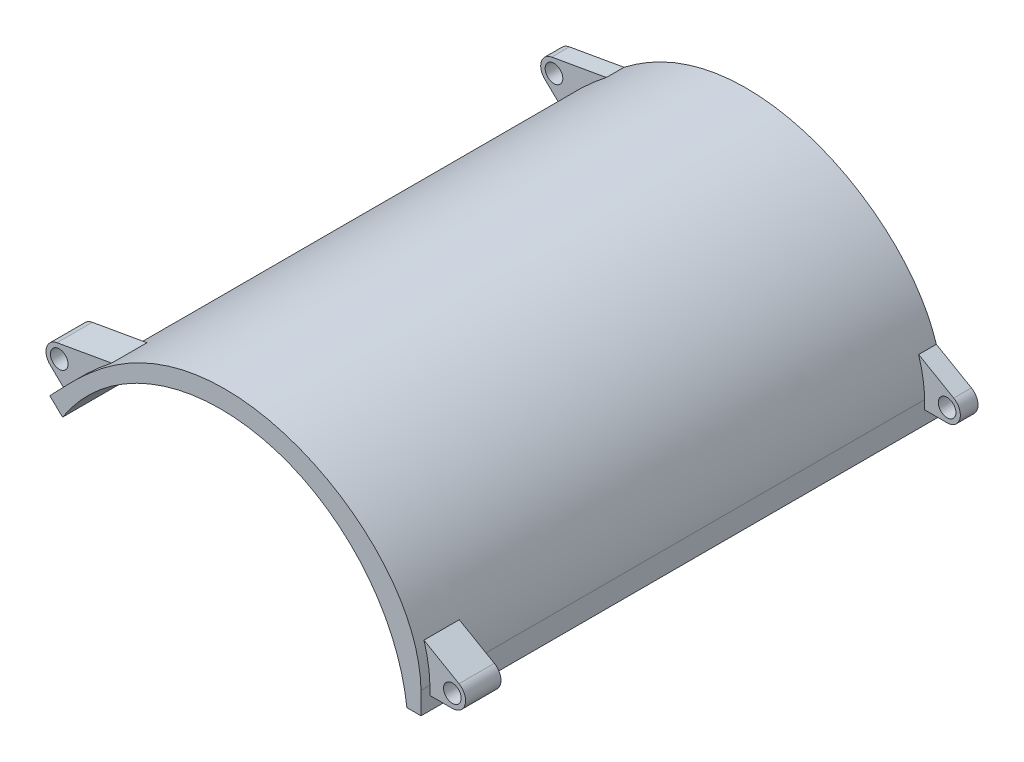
ISO-10303-21;
HEADER;
FILE_DESCRIPTION(('STEP AP214'),'2;1');
FILE_NAME('part.step','',(''),(''),'','','');
FILE_SCHEMA(('AUTOMOTIVE_DESIGN { 1 0 10303 214 1 1 1 1 }'));
ENDSEC;
DATA;
#1=APPLICATION_CONTEXT('core data for automotive mechanical design processes');
#2=APPLICATION_PROTOCOL_DEFINITION('international standard','automotive_design',2000,#1);
#3=PRODUCT_CONTEXT('',#1,'mechanical');
#4=PRODUCT('Part','Part','',(#3));
#5=PRODUCT_RELATED_PRODUCT_CATEGORY('part','',(#4));
#6=PRODUCT_DEFINITION_FORMATION('','',#4);
#7=PRODUCT_DEFINITION_CONTEXT('part definition',#1,'design');
#8=PRODUCT_DEFINITION('design','',#6,#7);
#9=PRODUCT_DEFINITION_SHAPE('','',#8);
#10=(LENGTH_UNIT() NAMED_UNIT(*) SI_UNIT(.MILLI.,.METRE.));
#11=(NAMED_UNIT(*) PLANE_ANGLE_UNIT() SI_UNIT($,.RADIAN.));
#12=(NAMED_UNIT(*) SI_UNIT($,.STERADIAN.) SOLID_ANGLE_UNIT());
#13=UNCERTAINTY_MEASURE_WITH_UNIT(LENGTH_MEASURE(1.E-05),#10,'distance_accuracy_value','');
#14=(GEOMETRIC_REPRESENTATION_CONTEXT(3) GLOBAL_UNCERTAINTY_ASSIGNED_CONTEXT((#13)) GLOBAL_UNIT_ASSIGNED_CONTEXT((#10,
#11,#12)) REPRESENTATION_CONTEXT('',''));
#15=CARTESIAN_POINT('',(0.,0.,0.));
#16=DIRECTION('',(0.,0.,1.));
#17=DIRECTION('',(1.,0.,0.));
#18=AXIS2_PLACEMENT_3D('',#15,#16,#17);
#19=CARTESIAN_POINT('',(479.524287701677,50.,295.));
#20=CARTESIAN_POINT('',(477.15378099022,170.567422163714,295.));
#21=CARTESIAN_POINT('',(359.356081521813,236.563554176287,295.));
#22=CARTESIAN_POINT('',(287.408844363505,253.328836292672,295.));
#23=CARTESIAN_POINT('',(219.133886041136,251.435560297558,295.));
#24=CARTESIAN_POINT('',(152.416815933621,225.58654086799,295.));
#25=CARTESIAN_POINT('',(108.187547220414,179.583185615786,295.));
#26=CARTESIAN_POINT('',(69.7200278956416,139.572690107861,295.));
#27=B_SPLINE_CURVE_WITH_KNOTS('',7,(#19,#20,#21,#22,#23,#24,#25,#26),.UNSPECIFIED.,.F.,.F.,(8,
8),(0.,1.),.UNSPECIFIED.);
#28=DIRECTION('',(0.,0.,-1.));
#29=VECTOR('',#28,1.);
#30=SURFACE_OF_LINEAR_EXTRUSION('',#27,#29);
#31=CARTESIAN_POINT('',(69.7200278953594,139.572690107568,245.));
#32=CARTESIAN_POINT('',(76.0741492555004,146.181682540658,245.));
#33=CARTESIAN_POINT('',(82.5854794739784,152.954189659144,245.));
#34=CARTESIAN_POINT('',(89.3294022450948,159.772367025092,245.));
#35=CARTESIAN_POINT('',(96.3532676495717,166.535005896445,245.));
#36=CARTESIAN_POINT('',(103.683856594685,173.1559041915,245.));
#37=CARTESIAN_POINT('',(111.333957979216,179.561593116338,245.));
#38=CARTESIAN_POINT('',(119.307330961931,185.688881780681,245.));
#39=B_SPLINE_CURVE_WITH_KNOTS('',7,(#31,#32,#33,#34,#35,#36,#37,#38),.UNSPECIFIED.,.F.,.F.,(8,
8),(0.,0.165181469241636),.UNSPECIFIED.);
#40=CARTESIAN_POINT('',(69.7200278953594,139.572690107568,245.));
#41=VERTEX_POINT('',#40);
#42=CARTESIAN_POINT('',(119.307330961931,185.688881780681,245.));
#43=VERTEX_POINT('',#42);
#44=EDGE_CURVE('E224',#41,#43,#39,.T.);
#45=ORIENTED_EDGE('',*,*,#44,.T.);
#46=DIRECTION('',(0.,0.,1.));
#47=VECTOR('',#46,1.);
#48=CARTESIAN_POINT('',(119.307330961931,185.688881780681,245.));
#49=LINE('',#48,#47);
#50=CARTESIAN_POINT('',(119.307330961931,185.688881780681,285.));
#51=VERTEX_POINT('',#50);
#52=EDGE_CURVE('E207',#43,#51,#49,.T.);
#53=ORIENTED_EDGE('',*,*,#52,.T.);
#54=CARTESIAN_POINT('',(69.7200278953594,139.572690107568,285.));
#55=CARTESIAN_POINT('',(76.0741492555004,146.181682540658,285.));
#56=CARTESIAN_POINT('',(82.5854794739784,152.954189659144,285.));
#57=CARTESIAN_POINT('',(89.3294022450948,159.772367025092,285.));
#58=CARTESIAN_POINT('',(96.3532676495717,166.535005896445,285.));
#59=CARTESIAN_POINT('',(103.683856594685,173.1559041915,285.));
#60=CARTESIAN_POINT('',(111.333957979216,179.561593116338,285.));
#61=CARTESIAN_POINT('',(119.307330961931,185.688881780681,285.));
#62=B_SPLINE_CURVE_WITH_KNOTS('',7,(#54,#55,#56,#57,#58,#59,#60,#61),.UNSPECIFIED.,.F.,.F.,(8,
8),(0.,0.165181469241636),.UNSPECIFIED.);
#63=CARTESIAN_POINT('',(69.7200278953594,139.572690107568,285.));
#64=VERTEX_POINT('',#63);
#65=EDGE_CURVE('E248',#64,#51,#62,.T.);
#66=ORIENTED_EDGE('',*,*,#65,.F.);
#67=DIRECTION('',(0.,0.,-1.));
#68=VECTOR('',#67,1.);
#69=CARTESIAN_POINT('',(69.7200278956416,139.572690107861,295.));
#70=LINE('',#69,#68);
#71=CARTESIAN_POINT('',(69.7200278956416,139.572690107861,295.));
#72=VERTEX_POINT('',#71);
#73=EDGE_CURVE('E461',#72,#64,#70,.T.);
#74=ORIENTED_EDGE('',*,*,#73,.F.);
#75=CARTESIAN_POINT('',(479.524287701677,50.,295.));
#76=VERTEX_POINT('',#75);
#77=EDGE_CURVE('E388',#76,#72,#27,.T.);
#78=ORIENTED_EDGE('',*,*,#77,.F.);
#79=DIRECTION('',(0.,0.,-1.));
#80=VECTOR('',#79,1.);
#81=CARTESIAN_POINT('',(479.524287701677,50.,295.));
#82=LINE('',#81,#80);
#83=CARTESIAN_POINT('',(479.524287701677,50.0000000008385,285.));
#84=VERTEX_POINT('',#83);
#85=EDGE_CURVE('E430',#76,#84,#82,.T.);
#86=ORIENTED_EDGE('',*,*,#85,.T.);
#87=CARTESIAN_POINT('',(472.826933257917,90.8956368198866,285.));
#88=CARTESIAN_POINT('',(474.517057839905,85.4877859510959,285.));
#89=CARTESIAN_POINT('',(475.993797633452,79.9371958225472,285.));
#90=CARTESIAN_POINT('',(477.239796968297,74.2424995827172,285.));
#91=CARTESIAN_POINT('',(478.236465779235,68.4024521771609,285.));
#92=CARTESIAN_POINT('',(478.963896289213,62.4159497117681,285.));
#93=CARTESIAN_POINT('',(479.40077470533,56.2820507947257,285.));
#94=CARTESIAN_POINT('',(479.524287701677,50.0000000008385,285.));
#95=B_SPLINE_CURVE_WITH_KNOTS('',7,(#87,#88,#89,#90,#91,#92,#93,#94),.UNSPECIFIED.,.F.,.F.,(8,
8),(0.94789595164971,1.),.UNSPECIFIED.);
#96=CARTESIAN_POINT('',(472.82693326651,90.8956367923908,285.));
#97=VERTEX_POINT('',#96);
#98=EDGE_CURVE('E269',#97,#84,#95,.T.);
#99=ORIENTED_EDGE('',*,*,#98,.F.);
#100=DIRECTION('',(0.,0.,1.));
#101=VECTOR('',#100,1.);
#102=CARTESIAN_POINT('',(472.826933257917,90.8956368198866,245.));
#103=LINE('',#102,#101);
#104=CARTESIAN_POINT('',(472.826933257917,90.8956368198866,245.));
#105=VERTEX_POINT('',#104);
#106=EDGE_CURVE('E308',#105,#97,#103,.T.);
#107=ORIENTED_EDGE('',*,*,#106,.F.);
#108=CARTESIAN_POINT('',(472.826933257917,90.8956368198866,245.));
#109=CARTESIAN_POINT('',(474.517057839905,85.4877859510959,245.));
#110=CARTESIAN_POINT('',(475.993797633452,79.9371958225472,245.));
#111=CARTESIAN_POINT('',(477.239796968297,74.2424995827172,245.));
#112=CARTESIAN_POINT('',(478.236465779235,68.4024521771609,245.));
#113=CARTESIAN_POINT('',(478.963896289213,62.4159497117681,245.));
#114=CARTESIAN_POINT('',(479.40077470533,56.2820507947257,245.));
#115=CARTESIAN_POINT('',(479.524287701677,50.0000000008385,245.));
#116=B_SPLINE_CURVE_WITH_KNOTS('',7,(#108,#109,#110,#111,#112,#113,#114,#115),.UNSPECIFIED.,.F.,
.F.,(8,8),(0.94789595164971,1.),.UNSPECIFIED.);
#117=CARTESIAN_POINT('',(479.524287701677,50.0000000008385,245.));
#118=VERTEX_POINT('',#117);
#119=EDGE_CURVE('E272',#105,#118,#116,.T.);
#120=ORIENTED_EDGE('',*,*,#119,.T.);
#121=CARTESIAN_POINT('',(479.524287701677,50.,-275.));
#122=VERTEX_POINT('',#121);
#123=EDGE_CURVE('E454',#118,#122,#82,.T.);
#124=ORIENTED_EDGE('',*,*,#123,.T.);
#125=CARTESIAN_POINT('',(472.826933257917,90.8956368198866,-275.));
#126=CARTESIAN_POINT('',(474.517057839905,85.4877859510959,-275.));
#127=CARTESIAN_POINT('',(475.993797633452,79.9371958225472,-275.));
#128=CARTESIAN_POINT('',(477.239796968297,74.2424995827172,-275.));
#129=CARTESIAN_POINT('',(478.236465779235,68.4024521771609,-275.));
#130=CARTESIAN_POINT('',(478.963896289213,62.4159497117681,-275.));
#131=CARTESIAN_POINT('',(479.40077470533,56.2820507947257,-275.));
#132=CARTESIAN_POINT('',(479.524287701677,50.0000000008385,-275.));
#133=B_SPLINE_CURVE_WITH_KNOTS('',7,(#125,#126,#127,#128,#129,#130,#131,#132),.UNSPECIFIED.,.F.,
.F.,(8,8),(0.,1.),.UNSPECIFIED.);
#134=CARTESIAN_POINT('',(472.82693326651,90.895636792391,-275.));
#135=VERTEX_POINT('',#134);
#136=EDGE_CURVE('E487',#135,#122,#133,.T.);
#137=ORIENTED_EDGE('',*,*,#136,.F.);
#138=DIRECTION('',(0.,0.,-1.));
#139=VECTOR('',#138,1.);
#140=CARTESIAN_POINT('',(472.826933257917,90.8956368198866,-275.));
#141=LINE('',#140,#139);
#142=CARTESIAN_POINT('',(472.826933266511,90.8956367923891,-295.));
#143=VERTEX_POINT('',#142);
#144=EDGE_CURVE('E365',#135,#143,#141,.T.);
#145=ORIENTED_EDGE('',*,*,#144,.T.);
#146=CARTESIAN_POINT('',(479.524287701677,50.,-295.));
#147=CARTESIAN_POINT('',(477.15378099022,170.567422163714,-295.));
#148=CARTESIAN_POINT('',(359.356081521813,236.563554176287,-295.));
#149=CARTESIAN_POINT('',(287.408844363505,253.328836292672,-295.));
#150=CARTESIAN_POINT('',(219.133886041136,251.435560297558,-295.));
#151=CARTESIAN_POINT('',(152.416815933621,225.58654086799,-295.));
#152=CARTESIAN_POINT('',(108.187547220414,179.583185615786,-295.));
#153=CARTESIAN_POINT('',(69.7200278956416,139.572690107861,-295.));
#154=B_SPLINE_CURVE_WITH_KNOTS('',7,(#146,#147,#148,#149,#150,#151,#152,#153),.UNSPECIFIED.,.F.,
.F.,(8,8),(0.,1.),.UNSPECIFIED.);
#155=CARTESIAN_POINT('',(119.307330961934,185.688881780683,-295.));
#156=VERTEX_POINT('',#155);
#157=EDGE_CURVE('E436',#143,#156,#154,.T.);
#158=ORIENTED_EDGE('',*,*,#157,.T.);
#159=DIRECTION('',(0.,0.,-1.));
#160=VECTOR('',#159,1.);
#161=CARTESIAN_POINT('',(119.307330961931,185.688881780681,-275.));
#162=LINE('',#161,#160);
#163=CARTESIAN_POINT('',(119.307330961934,185.688881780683,-275.));
#164=VERTEX_POINT('',#163);
#165=EDGE_CURVE('E310',#164,#156,#162,.T.);
#166=ORIENTED_EDGE('',*,*,#165,.F.);
#167=CARTESIAN_POINT('',(69.7200278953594,139.572690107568,-275.));
#168=CARTESIAN_POINT('',(76.0741492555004,146.181682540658,-275.));
#169=CARTESIAN_POINT('',(82.5854794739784,152.954189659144,-275.));
#170=CARTESIAN_POINT('',(89.3294022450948,159.772367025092,-275.));
#171=CARTESIAN_POINT('',(96.3532676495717,166.535005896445,-275.));
#172=CARTESIAN_POINT('',(103.683856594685,173.1559041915,-275.));
#173=CARTESIAN_POINT('',(111.333957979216,179.561593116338,-275.));
#174=CARTESIAN_POINT('',(119.307330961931,185.688881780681,-275.));
#175=B_SPLINE_CURVE_WITH_KNOTS('',7,(#167,#168,#169,#170,#171,#172,#173,#174),.UNSPECIFIED.,.F.,
.F.,(8,8),(0.,1.),.UNSPECIFIED.);
#176=CARTESIAN_POINT('',(69.7200278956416,139.572690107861,-275.));
#177=VERTEX_POINT('',#176);
#178=EDGE_CURVE('E320',#177,#164,#175,.T.);
#179=ORIENTED_EDGE('',*,*,#178,.F.);
#180=EDGE_CURVE('E45',#41,#177,#70,.T.);
#181=ORIENTED_EDGE('',*,*,#180,.F.);
#182=EDGE_LOOP('',(#45,#53,#66,#74,#78,#86,#99,#107,#120,#124,#137,#145,#158,#166,#179,#181));
#183=FACE_BOUND('',#182,.T.);
#184=ADVANCED_FACE('F41',(#183),#30,.F.);
#185=CARTESIAN_POINT('',(59.3239744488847,128.759639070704,295.));
#186=DIRECTION('',(0.720870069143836,-0.693070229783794,0.));
#187=DIRECTION('',(0.693070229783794,0.720870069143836,0.));
#188=AXIS2_PLACEMENT_3D('',#185,#186,#187);
#189=PLANE('',#188);
#190=DIRECTION('',(0.693070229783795,0.720870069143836,0.));
#191=VECTOR('',#190,1.);
#192=CARTESIAN_POINT('',(64.8607561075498,134.51850737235,245.));
#193=LINE('',#192,#191);
#194=CARTESIAN_POINT('',(64.8607561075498,134.51850737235,245.));
#195=VERTEX_POINT('',#194);
#196=EDGE_CURVE('E218',#195,#41,#193,.T.);
#197=ORIENTED_EDGE('',*,*,#196,.T.);
#198=ORIENTED_EDGE('',*,*,#180,.T.);
#199=DIRECTION('',(-0.693070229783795,-0.720870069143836,0.));
#200=VECTOR('',#199,1.);
#201=CARTESIAN_POINT('',(87.7853071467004,158.362588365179,-275.));
#202=LINE('',#201,#200);
#203=CARTESIAN_POINT('',(64.8607561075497,134.51850737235,-275.));
#204=VERTEX_POINT('',#203);
#205=EDGE_CURVE('E342',#177,#204,#202,.T.);
#206=ORIENTED_EDGE('',*,*,#205,.T.);
#207=DIRECTION('',(0.,0.,-1.));
#208=VECTOR('',#207,1.);
#209=CARTESIAN_POINT('',(64.8607561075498,134.51850737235,-275.));
#210=LINE('',#209,#208);
#211=CARTESIAN_POINT('',(64.8607561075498,134.51850737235,-295.));
#212=VERTEX_POINT('',#211);
#213=EDGE_CURVE('E317',#204,#212,#210,.T.);
#214=ORIENTED_EDGE('',*,*,#213,.T.);
#215=DIRECTION('',(-0.693070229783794,-0.720870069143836,0.));
#216=VECTOR('',#215,1.);
#217=CARTESIAN_POINT('',(59.3239744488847,128.759639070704,-295.));
#218=LINE('',#217,#216);
#219=CARTESIAN_POINT('',(59.3239744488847,128.759639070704,-295.));
#220=VERTEX_POINT('',#219);
#221=EDGE_CURVE('E438',#212,#220,#218,.T.);
#222=ORIENTED_EDGE('',*,*,#221,.T.);
#223=DIRECTION('',(0.,0.,-1.));
#224=VECTOR('',#223,1.);
#225=CARTESIAN_POINT('',(59.3239744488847,128.759639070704,295.));
#226=LINE('',#225,#224);
#227=CARTESIAN_POINT('',(59.3239744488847,128.759639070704,295.));
#228=VERTEX_POINT('',#227);
#229=EDGE_CURVE('E540',#228,#220,#226,.T.);
#230=ORIENTED_EDGE('',*,*,#229,.F.);
#231=DIRECTION('',(-0.693070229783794,-0.720870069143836,0.));
#232=VECTOR('',#231,1.);
#233=CARTESIAN_POINT('',(59.3239744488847,128.759639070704,295.));
#234=LINE('',#233,#232);
#235=EDGE_CURVE('E393',#72,#228,#234,.T.);
#236=ORIENTED_EDGE('',*,*,#235,.F.);
#237=ORIENTED_EDGE('',*,*,#73,.T.);
#238=DIRECTION('',(0.693070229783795,0.720870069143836,0.));
#239=VECTOR('',#238,1.);
#240=CARTESIAN_POINT('',(64.8607561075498,134.51850737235,285.));
#241=LINE('',#240,#239);
#242=CARTESIAN_POINT('',(64.8607561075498,134.51850737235,285.));
#243=VERTEX_POINT('',#242);
#244=EDGE_CURVE('E232',#243,#64,#241,.T.);
#245=ORIENTED_EDGE('',*,*,#244,.F.);
#246=DIRECTION('',(0.,0.,1.));
#247=VECTOR('',#246,1.);
#248=CARTESIAN_POINT('',(64.8607561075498,134.51850737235,245.));
#249=LINE('',#248,#247);
#250=EDGE_CURVE('E260',#195,#243,#249,.T.);
#251=ORIENTED_EDGE('',*,*,#250,.F.);
#252=EDGE_LOOP('',(#197,#198,#206,#214,#222,#230,#236,#237,#245,#251));
#253=FACE_BOUND('',#252,.T.);
#254=ADVANCED_FACE('F402',(#253),#189,.F.);
#255=CARTESIAN_POINT('',(479.524287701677,25.,295.));
#256=DIRECTION('',(-1.,0.,0.));
#257=DIRECTION('',(0.,-1.,0.));
#258=AXIS2_PLACEMENT_3D('',#255,#256,#257);
#259=PLANE('',#258);
#260=DIRECTION('',(0.,-1.,0.));
#261=VECTOR('',#260,1.);
#262=CARTESIAN_POINT('',(479.524287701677,50.0000000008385,245.));
#263=LINE('',#262,#261);
#264=CARTESIAN_POINT('',(479.524287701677,40.,245.));
#265=VERTEX_POINT('',#264);
#266=EDGE_CURVE('E277',#118,#265,#263,.T.);
#267=ORIENTED_EDGE('',*,*,#266,.T.);
#268=DIRECTION('',(0.,0.,1.));
#269=VECTOR('',#268,1.);
#270=CARTESIAN_POINT('',(479.524287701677,40.,245.));
#271=LINE('',#270,#269);
#272=CARTESIAN_POINT('',(479.524287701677,40.,285.));
#273=VERTEX_POINT('',#272);
#274=EDGE_CURVE('E292',#265,#273,#271,.T.);
#275=ORIENTED_EDGE('',*,*,#274,.T.);
#276=DIRECTION('',(0.,-1.,0.));
#277=VECTOR('',#276,1.);
#278=CARTESIAN_POINT('',(479.524287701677,50.0000000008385,285.));
#279=LINE('',#278,#277);
#280=EDGE_CURVE('E296',#84,#273,#279,.T.);
#281=ORIENTED_EDGE('',*,*,#280,.F.);
#282=ORIENTED_EDGE('',*,*,#85,.F.);
#283=DIRECTION('',(0.,1.,0.));
#284=VECTOR('',#283,1.);
#285=CARTESIAN_POINT('',(479.524287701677,25.,295.));
#286=LINE('',#285,#284);
#287=CARTESIAN_POINT('',(479.524287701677,25.,295.));
#288=VERTEX_POINT('',#287);
#289=EDGE_CURVE('E386',#288,#76,#286,.T.);
#290=ORIENTED_EDGE('',*,*,#289,.F.);
#291=DIRECTION('',(0.,0.,-1.));
#292=VECTOR('',#291,1.);
#293=CARTESIAN_POINT('',(479.524287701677,25.,295.));
#294=LINE('',#293,#292);
#295=CARTESIAN_POINT('',(479.524287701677,25.,-295.));
#296=VERTEX_POINT('',#295);
#297=EDGE_CURVE('E51',#288,#296,#294,.T.);
#298=ORIENTED_EDGE('',*,*,#297,.T.);
#299=DIRECTION('',(0.,1.,0.));
#300=VECTOR('',#299,1.);
#301=CARTESIAN_POINT('',(479.524287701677,25.,-295.));
#302=LINE('',#301,#300);
#303=CARTESIAN_POINT('',(479.524287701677,40.,-295.));
#304=VERTEX_POINT('',#303);
#305=EDGE_CURVE('E427',#296,#304,#302,.T.);
#306=ORIENTED_EDGE('',*,*,#305,.T.);
#307=DIRECTION('',(0.,0.,-1.));
#308=VECTOR('',#307,1.);
#309=CARTESIAN_POINT('',(479.524287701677,40.,-275.));
#310=LINE('',#309,#308);
#311=CARTESIAN_POINT('',(479.524287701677,40.,-275.));
#312=VERTEX_POINT('',#311);
#313=EDGE_CURVE('E376',#312,#304,#310,.T.);
#314=ORIENTED_EDGE('',*,*,#313,.F.);
#315=DIRECTION('',(0.,1.,0.));
#316=VECTOR('',#315,1.);
#317=CARTESIAN_POINT('',(479.524287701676,-1.107582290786E-12,-275.));
#318=LINE('',#317,#316);
#319=EDGE_CURVE('E359',#312,#122,#318,.T.);
#320=ORIENTED_EDGE('',*,*,#319,.T.);
#321=ORIENTED_EDGE('',*,*,#123,.F.);
#322=EDGE_LOOP('',(#267,#275,#281,#282,#290,#298,#306,#314,#320,#321));
#323=FACE_BOUND('',#322,.T.);
#324=ADVANCED_FACE('F404',(#323),#259,.F.);
#325=CARTESIAN_POINT('',(252.5,1.52655665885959E-13,295.));
#326=DIRECTION('',(0.,0.,-1.));
#327=DIRECTION('',(-1.,0.,0.));
#328=AXIS2_PLACEMENT_3D('',#325,#326,#327);
#329=CYLINDRICAL_SURFACE('',#328,212.5);
#330=CARTESIAN_POINT('',(252.5,1.52655665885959E-13,-295.));
#331=DIRECTION('',(0.,0.,-1.));
#332=DIRECTION('',(-1.,0.,0.));
#333=AXIS2_PLACEMENT_3D('',#330,#331,#332);
#334=CIRCLE('',#333,212.5);
#335=CARTESIAN_POINT('',(73.7413758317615,114.898234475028,-295.));
#336=VERTEX_POINT('',#335);
#337=CARTESIAN_POINT('',(463.524287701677,25.,-295.));
#338=VERTEX_POINT('',#337);
#339=EDGE_CURVE('E379',#336,#338,#334,.T.);
#340=ORIENTED_EDGE('',*,*,#339,.T.);
#341=DIRECTION('',(0.,0.,-1.));
#342=VECTOR('',#341,1.);
#343=CARTESIAN_POINT('',(463.524287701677,25.,295.));
#344=LINE('',#343,#342);
#345=CARTESIAN_POINT('',(463.524287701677,25.,295.));
#346=VERTEX_POINT('',#345);
#347=EDGE_CURVE('E11',#346,#338,#344,.T.);
#348=ORIENTED_EDGE('',*,*,#347,.F.);
#349=CARTESIAN_POINT('',(252.5,1.52655665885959E-13,295.));
#350=DIRECTION('',(0.,0.,-1.));
#351=DIRECTION('',(-1.,0.,0.));
#352=AXIS2_PLACEMENT_3D('',#349,#350,#351);
#353=CIRCLE('',#352,212.5);
#354=CARTESIAN_POINT('',(73.7413758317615,114.898234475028,295.));
#355=VERTEX_POINT('',#354);
#356=EDGE_CURVE('E380',#355,#346,#353,.T.);
#357=ORIENTED_EDGE('',*,*,#356,.F.);
#358=DIRECTION('',(0.,0.,-1.));
#359=VECTOR('',#358,1.);
#360=CARTESIAN_POINT('',(73.7413758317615,114.898234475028,295.));
#361=LINE('',#360,#359);
#362=EDGE_CURVE('E539',#355,#336,#361,.T.);
#363=ORIENTED_EDGE('',*,*,#362,.T.);
#364=EDGE_LOOP('',(#340,#348,#357,#363));
#365=FACE_BOUND('',#364,.T.);
#366=ADVANCED_FACE('F43',(#365),#329,.F.);
#367=CARTESIAN_POINT('',(463.524287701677,25.,295.));
#368=DIRECTION('',(0.,1.,0.));
#369=DIRECTION('',(0.,0.,1.));
#370=AXIS2_PLACEMENT_3D('',#367,#368,#369);
#371=PLANE('',#370);
#372=DIRECTION('',(1.,0.,0.));
#373=VECTOR('',#372,1.);
#374=CARTESIAN_POINT('',(463.524287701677,25.,-295.));
#375=LINE('',#374,#373);
#376=EDGE_CURVE('E419',#338,#296,#375,.T.);
#377=ORIENTED_EDGE('',*,*,#376,.T.);
#378=ORIENTED_EDGE('',*,*,#297,.F.);
#379=DIRECTION('',(1.,0.,0.));
#380=VECTOR('',#379,1.);
#381=CARTESIAN_POINT('',(463.524287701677,25.,295.));
#382=LINE('',#381,#380);
#383=EDGE_CURVE('E383',#346,#288,#382,.T.);
#384=ORIENTED_EDGE('',*,*,#383,.F.);
#385=ORIENTED_EDGE('',*,*,#347,.T.);
#386=EDGE_LOOP('',(#377,#378,#384,#385));
#387=FACE_BOUND('',#386,.T.);
#388=ADVANCED_FACE('F407',(#387),#371,.F.);
#389=CARTESIAN_POINT('',(59.3239744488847,128.759639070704,295.));
#390=DIRECTION('',(0.693070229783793,0.720870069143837,0.));
#391=DIRECTION('',(-0.720870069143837,0.693070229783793,0.));
#392=AXIS2_PLACEMENT_3D('',#389,#390,#391);
#393=PLANE('',#392);
#394=DIRECTION('',(0.720870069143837,-0.693070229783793,0.));
#395=VECTOR('',#394,1.);
#396=CARTESIAN_POINT('',(59.3239744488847,128.759639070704,-295.));
#397=LINE('',#396,#395);
#398=EDGE_CURVE('E384',#220,#336,#397,.T.);
#399=ORIENTED_EDGE('',*,*,#398,.T.);
#400=ORIENTED_EDGE('',*,*,#362,.F.);
#401=DIRECTION('',(0.720870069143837,-0.693070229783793,0.));
#402=VECTOR('',#401,1.);
#403=CARTESIAN_POINT('',(59.3239744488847,128.759639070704,295.));
#404=LINE('',#403,#402);
#405=EDGE_CURVE('E541',#228,#355,#404,.T.);
#406=ORIENTED_EDGE('',*,*,#405,.F.);
#407=ORIENTED_EDGE('',*,*,#229,.T.);
#408=EDGE_LOOP('',(#399,#400,#406,#407));
#409=FACE_BOUND('',#408,.T.);
#410=ADVANCED_FACE('F409',(#409),#393,.F.);
#411=CARTESIAN_POINT('',(252.5,1.52655665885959E-13,295.));
#412=DIRECTION('',(0.,0.,-1.));
#413=DIRECTION('',(-1.,0.,0.));
#414=AXIS2_PLACEMENT_3D('',#411,#412,#413);
#415=PLANE('',#414);
#416=ORIENTED_EDGE('',*,*,#356,.T.);
#417=ORIENTED_EDGE('',*,*,#383,.T.);
#418=ORIENTED_EDGE('',*,*,#289,.T.);
#419=ORIENTED_EDGE('',*,*,#77,.T.);
#420=ORIENTED_EDGE('',*,*,#235,.T.);
#421=ORIENTED_EDGE('',*,*,#405,.T.);
#422=EDGE_LOOP('',(#416,#417,#418,#419,#420,#421));
#423=FACE_BOUND('',#422,.T.);
#424=ADVANCED_FACE('F415',(#423),#415,.F.);
#425=CARTESIAN_POINT('',(252.5,1.52655665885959E-13,-295.));
#426=DIRECTION('',(0.,0.,-1.));
#427=DIRECTION('',(-1.,0.,0.));
#428=AXIS2_PLACEMENT_3D('',#425,#426,#427);
#429=PLANE('',#428);
#430=DIRECTION('',(0.984807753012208,0.173648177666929,0.));
#431=VECTOR('',#430,1.);
#432=CARTESIAN_POINT('',(216.729080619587,202.866964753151,-295.));
#433=LINE('',#432,#431);
#434=CARTESIAN_POINT('',(57.3952773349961,174.772116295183,-295.));
#435=VERTEX_POINT('',#434);
#436=EDGE_CURVE('E329',#435,#156,#433,.T.);
#437=ORIENTED_EDGE('',*,*,#436,.T.);
#438=ORIENTED_EDGE('',*,*,#157,.F.);
#439=DIRECTION('',(0.866025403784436,-0.500000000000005,0.));
#440=VECTOR('',#439,1.);
#441=CARTESIAN_POINT('',(346.940698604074,163.576088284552,-295.));
#442=LINE('',#441,#440);
#443=CARTESIAN_POINT('',(512.5,67.9903810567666,-295.));
#444=VERTEX_POINT('',#443);
#445=EDGE_CURVE('E371',#143,#444,#442,.T.);
#446=ORIENTED_EDGE('',*,*,#445,.T.);
#447=CARTESIAN_POINT('',(505.,55.,-295.));
#448=DIRECTION('',(0.,0.,-1.));
#449=DIRECTION('',(-1.,0.,0.));
#450=AXIS2_PLACEMENT_3D('',#447,#448,#449);
#451=CIRCLE('',#450,15.);
#452=CARTESIAN_POINT('',(505.,40.,-295.));
#453=VERTEX_POINT('',#452);
#454=EDGE_CURVE('E368',#444,#453,#451,.T.);
#455=ORIENTED_EDGE('',*,*,#454,.T.);
#456=DIRECTION('',(-1.,0.,0.));
#457=VECTOR('',#456,1.);
#458=CARTESIAN_POINT('',(252.5,40.,-295.));
#459=LINE('',#458,#457);
#460=EDGE_CURVE('E352',#453,#304,#459,.T.);
#461=ORIENTED_EDGE('',*,*,#460,.T.);
#462=ORIENTED_EDGE('',*,*,#305,.F.);
#463=ORIENTED_EDGE('',*,*,#376,.F.);
#464=ORIENTED_EDGE('',*,*,#339,.F.);
#465=ORIENTED_EDGE('',*,*,#398,.F.);
#466=ORIENTED_EDGE('',*,*,#221,.F.);
#467=DIRECTION('',(-0.720870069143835,0.693070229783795,0.));
#468=VECTOR('',#467,1.);
#469=CARTESIAN_POINT('',(229.575448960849,-23.8440809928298,-295.));
#470=LINE('',#469,#468);
#471=CARTESIAN_POINT('',(49.6039465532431,149.186948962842,-295.));
#472=VERTEX_POINT('',#471);
#473=EDGE_CURVE('E328',#212,#472,#470,.T.);
#474=ORIENTED_EDGE('',*,*,#473,.T.);
#475=CARTESIAN_POINT('',(60.0000000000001,160.,-295.));
#476=DIRECTION('',(0.,0.,-1.));
#477=DIRECTION('',(-1.,0.,0.));
#478=AXIS2_PLACEMENT_3D('',#475,#476,#477);
#479=CIRCLE('',#478,15.);
#480=EDGE_CURVE('E325',#472,#435,#479,.T.);
#481=ORIENTED_EDGE('',*,*,#480,.T.);
#482=EDGE_LOOP('',(#437,#438,#446,#455,#461,#462,#463,#464,#465,#466,#474,#481));
#483=FACE_BOUND('',#482,.T.);
#484=CARTESIAN_POINT('',(505.,55.,-295.));
#485=DIRECTION('',(0.,0.,-1.));
#486=DIRECTION('',(-1.,0.,0.));
#487=AXIS2_PLACEMENT_3D('',#484,#485,#486);
#488=CIRCLE('',#487,9.99999999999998);
#489=CARTESIAN_POINT('',(495.,55.,-295.));
#490=VERTEX_POINT('',#489);
#491=EDGE_CURVE('E346',#490,#490,#488,.T.);
#492=ORIENTED_EDGE('',*,*,#491,.F.);
#493=EDGE_LOOP('',(#492));
#494=FACE_BOUND('',#493,.T.);
#495=CARTESIAN_POINT('',(60.0000000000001,160.,-295.));
#496=DIRECTION('',(0.,0.,-1.));
#497=DIRECTION('',(-1.,0.,0.));
#498=AXIS2_PLACEMENT_3D('',#495,#496,#497);
#499=CIRCLE('',#498,9.99999999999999);
#500=CARTESIAN_POINT('',(50.0000000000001,160.,-295.));
#501=VERTEX_POINT('',#500);
#502=EDGE_CURVE('E343',#501,#501,#499,.T.);
#503=ORIENTED_EDGE('',*,*,#502,.F.);
#504=EDGE_LOOP('',(#503));
#505=FACE_BOUND('',#504,.T.);
#506=ADVANCED_FACE('F433',(#483,#494,#505),#429,.T.);
#507=CARTESIAN_POINT('',(252.5,40.,-275.));
#508=DIRECTION('',(0.,-1.,0.));
#509=DIRECTION('',(0.,0.,-1.));
#510=AXIS2_PLACEMENT_3D('',#507,#508,#509);
#511=PLANE('',#510);
#512=ORIENTED_EDGE('',*,*,#460,.F.);
#513=DIRECTION('',(0.,0.,-1.));
#514=VECTOR('',#513,1.);
#515=CARTESIAN_POINT('',(505.,40.,-275.));
#516=LINE('',#515,#514);
#517=CARTESIAN_POINT('',(505.,40.,-275.));
#518=VERTEX_POINT('',#517);
#519=EDGE_CURVE('E374',#518,#453,#516,.T.);
#520=ORIENTED_EDGE('',*,*,#519,.F.);
#521=DIRECTION('',(-1.,0.,0.));
#522=VECTOR('',#521,1.);
#523=CARTESIAN_POINT('',(252.5,40.,-275.));
#524=LINE('',#523,#522);
#525=EDGE_CURVE('E355',#518,#312,#524,.T.);
#526=ORIENTED_EDGE('',*,*,#525,.T.);
#527=ORIENTED_EDGE('',*,*,#313,.T.);
#528=EDGE_LOOP('',(#512,#520,#526,#527));
#529=FACE_BOUND('',#528,.T.);
#530=ADVANCED_FACE('F509',(#529),#511,.T.);
#531=CARTESIAN_POINT('',(505.,55.,-275.));
#532=DIRECTION('',(0.,0.,-1.));
#533=DIRECTION('',(-1.,0.,0.));
#534=AXIS2_PLACEMENT_3D('',#531,#532,#533);
#535=CYLINDRICAL_SURFACE('',#534,15.);
#536=ORIENTED_EDGE('',*,*,#454,.F.);
#537=DIRECTION('',(0.,0.,-1.));
#538=VECTOR('',#537,1.);
#539=CARTESIAN_POINT('',(512.5,67.9903810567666,-275.));
#540=LINE('',#539,#538);
#541=CARTESIAN_POINT('',(512.5,67.9903810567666,-275.));
#542=VERTEX_POINT('',#541);
#543=EDGE_CURVE('E372',#542,#444,#540,.T.);
#544=ORIENTED_EDGE('',*,*,#543,.F.);
#545=CARTESIAN_POINT('',(505.,55.,-275.));
#546=DIRECTION('',(0.,0.,-1.));
#547=DIRECTION('',(-1.,0.,0.));
#548=AXIS2_PLACEMENT_3D('',#545,#546,#547);
#549=CIRCLE('',#548,15.);
#550=EDGE_CURVE('E358',#542,#518,#549,.T.);
#551=ORIENTED_EDGE('',*,*,#550,.T.);
#552=ORIENTED_EDGE('',*,*,#519,.T.);
#553=EDGE_LOOP('',(#536,#544,#551,#552));
#554=FACE_BOUND('',#553,.T.);
#555=ADVANCED_FACE('F512',(#554),#535,.T.);
#556=CARTESIAN_POINT('',(346.940698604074,163.576088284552,-275.));
#557=DIRECTION('',(0.500000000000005,0.866025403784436,0.));
#558=DIRECTION('',(-0.866025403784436,0.500000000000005,0.));
#559=AXIS2_PLACEMENT_3D('',#556,#557,#558);
#560=PLANE('',#559);
#561=ORIENTED_EDGE('',*,*,#445,.F.);
#562=ORIENTED_EDGE('',*,*,#144,.F.);
#563=DIRECTION('',(0.866025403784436,-0.500000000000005,0.));
#564=VECTOR('',#563,1.);
#565=CARTESIAN_POINT('',(346.940698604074,163.576088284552,-275.));
#566=LINE('',#565,#564);
#567=EDGE_CURVE('E362',#135,#542,#566,.T.);
#568=ORIENTED_EDGE('',*,*,#567,.T.);
#569=ORIENTED_EDGE('',*,*,#543,.T.);
#570=EDGE_LOOP('',(#561,#562,#568,#569));
#571=FACE_BOUND('',#570,.T.);
#572=ADVANCED_FACE('F516',(#571),#560,.T.);
#573=CARTESIAN_POINT('',(477.54341263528,71.2130770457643,-275.));
#574=DIRECTION('',(0.,0.,1.));
#575=DIRECTION('',(1.,0.,0.));
#576=AXIS2_PLACEMENT_3D('',#573,#574,#575);
#577=PLANE('',#576);
#578=CARTESIAN_POINT('',(505.,55.,-275.));
#579=DIRECTION('',(0.,0.,-1.));
#580=DIRECTION('',(-1.,0.,0.));
#581=AXIS2_PLACEMENT_3D('',#578,#579,#580);
#582=CIRCLE('',#581,9.99999999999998);
#583=CARTESIAN_POINT('',(495.,55.,-275.));
#584=VERTEX_POINT('',#583);
#585=EDGE_CURVE('E349',#584,#584,#582,.T.);
#586=ORIENTED_EDGE('',*,*,#585,.T.);
#587=EDGE_LOOP('',(#586));
#588=FACE_BOUND('',#587,.T.);
#589=ORIENTED_EDGE('',*,*,#136,.T.);
#590=ORIENTED_EDGE('',*,*,#319,.F.);
#591=ORIENTED_EDGE('',*,*,#525,.F.);
#592=ORIENTED_EDGE('',*,*,#550,.F.);
#593=ORIENTED_EDGE('',*,*,#567,.F.);
#594=EDGE_LOOP('',(#589,#590,#591,#592,#593));
#595=FACE_BOUND('',#594,.T.);
#596=ADVANCED_FACE('F506',(#588,#595),#577,.T.);
#597=CARTESIAN_POINT('',(505.,55.,-275.));
#598=DIRECTION('',(0.,0.,-1.));
#599=DIRECTION('',(-1.,0.,0.));
#600=AXIS2_PLACEMENT_3D('',#597,#598,#599);
#601=CYLINDRICAL_SURFACE('',#600,9.99999999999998);
#602=ORIENTED_EDGE('',*,*,#585,.F.);
#603=EDGE_LOOP('',(#602));
#604=FACE_BOUND('',#603,.T.);
#605=ORIENTED_EDGE('',*,*,#491,.T.);
#606=EDGE_LOOP('',(#605));
#607=FACE_BOUND('',#606,.T.);
#608=ADVANCED_FACE('F601',(#604,#607),#601,.F.);
#609=CARTESIAN_POINT('',(216.729080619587,202.866964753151,-275.));
#610=DIRECTION('',(-0.173648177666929,0.984807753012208,0.));
#611=DIRECTION('',(-0.984807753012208,-0.173648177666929,0.));
#612=AXIS2_PLACEMENT_3D('',#609,#610,#611);
#613=PLANE('',#612);
#614=ORIENTED_EDGE('',*,*,#436,.F.);
#615=DIRECTION('',(0.,0.,-1.));
#616=VECTOR('',#615,1.);
#617=CARTESIAN_POINT('',(57.3952773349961,174.772116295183,-275.));
#618=LINE('',#617,#616);
#619=CARTESIAN_POINT('',(57.3952773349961,174.772116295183,-275.));
#620=VERTEX_POINT('',#619);
#621=EDGE_CURVE('E323',#620,#435,#618,.T.);
#622=ORIENTED_EDGE('',*,*,#621,.F.);
#623=DIRECTION('',(0.984807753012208,0.173648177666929,0.));
#624=VECTOR('',#623,1.);
#625=CARTESIAN_POINT('',(216.729080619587,202.866964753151,-275.));
#626=LINE('',#625,#624);
#627=EDGE_CURVE('E333',#620,#164,#626,.T.);
#628=ORIENTED_EDGE('',*,*,#627,.T.);
#629=ORIENTED_EDGE('',*,*,#165,.T.);
#630=EDGE_LOOP('',(#614,#622,#628,#629));
#631=FACE_BOUND('',#630,.T.);
#632=ADVANCED_FACE('F521',(#631),#613,.T.);
#633=CARTESIAN_POINT('',(60.0000000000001,160.,-275.));
#634=DIRECTION('',(0.,0.,-1.));
#635=DIRECTION('',(-1.,0.,0.));
#636=AXIS2_PLACEMENT_3D('',#633,#634,#635);
#637=CYLINDRICAL_SURFACE('',#636,15.);
#638=ORIENTED_EDGE('',*,*,#480,.F.);
#639=DIRECTION('',(0.,0.,-1.));
#640=VECTOR('',#639,1.);
#641=CARTESIAN_POINT('',(49.6039465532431,149.186948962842,-275.));
#642=LINE('',#641,#640);
#643=CARTESIAN_POINT('',(49.6039465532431,149.186948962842,-275.));
#644=VERTEX_POINT('',#643);
#645=EDGE_CURVE('E321',#644,#472,#642,.T.);
#646=ORIENTED_EDGE('',*,*,#645,.F.);
#647=CARTESIAN_POINT('',(60.0000000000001,160.,-275.));
#648=DIRECTION('',(0.,0.,-1.));
#649=DIRECTION('',(-1.,0.,0.));
#650=AXIS2_PLACEMENT_3D('',#647,#648,#649);
#651=CIRCLE('',#650,15.);
#652=EDGE_CURVE('E336',#644,#620,#651,.T.);
#653=ORIENTED_EDGE('',*,*,#652,.T.);
#654=ORIENTED_EDGE('',*,*,#621,.T.);
#655=EDGE_LOOP('',(#638,#646,#653,#654));
#656=FACE_BOUND('',#655,.T.);
#657=ADVANCED_FACE('F595',(#656),#637,.T.);
#658=CARTESIAN_POINT('',(229.575448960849,-23.8440809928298,-275.));
#659=DIRECTION('',(-0.693070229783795,-0.720870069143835,0.));
#660=DIRECTION('',(0.720870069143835,-0.693070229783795,0.));
#661=AXIS2_PLACEMENT_3D('',#658,#659,#660);
#662=PLANE('',#661);
#663=ORIENTED_EDGE('',*,*,#473,.F.);
#664=ORIENTED_EDGE('',*,*,#213,.F.);
#665=DIRECTION('',(-0.720870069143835,0.693070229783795,0.));
#666=VECTOR('',#665,1.);
#667=CARTESIAN_POINT('',(229.575448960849,-23.8440809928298,-275.));
#668=LINE('',#667,#666);
#669=EDGE_CURVE('E339',#204,#644,#668,.T.);
#670=ORIENTED_EDGE('',*,*,#669,.T.);
#671=ORIENTED_EDGE('',*,*,#645,.T.);
#672=EDGE_LOOP('',(#663,#664,#670,#671));
#673=FACE_BOUND('',#672,.T.);
#674=ADVANCED_FACE('F532',(#673),#662,.T.);
#675=CARTESIAN_POINT('',(60.0000000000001,160.,-275.));
#676=DIRECTION('',(0.,0.,-1.));
#677=DIRECTION('',(-1.,0.,0.));
#678=AXIS2_PLACEMENT_3D('',#675,#676,#677);
#679=PLANE('',#678);
#680=CARTESIAN_POINT('',(60.0000000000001,160.,-275.));
#681=DIRECTION('',(0.,0.,-1.));
#682=DIRECTION('',(-1.,0.,0.));
#683=AXIS2_PLACEMENT_3D('',#680,#681,#682);
#684=CIRCLE('',#683,9.99999999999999);
#685=CARTESIAN_POINT('',(50.0000000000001,160.,-275.));
#686=VERTEX_POINT('',#685);
#687=EDGE_CURVE('E332',#686,#686,#684,.T.);
#688=ORIENTED_EDGE('',*,*,#687,.T.);
#689=EDGE_LOOP('',(#688));
#690=FACE_BOUND('',#689,.T.);
#691=ORIENTED_EDGE('',*,*,#205,.F.);
#692=ORIENTED_EDGE('',*,*,#178,.T.);
#693=ORIENTED_EDGE('',*,*,#627,.F.);
#694=ORIENTED_EDGE('',*,*,#652,.F.);
#695=ORIENTED_EDGE('',*,*,#669,.F.);
#696=EDGE_LOOP('',(#691,#692,#693,#694,#695));
#697=FACE_BOUND('',#696,.T.);
#698=ADVANCED_FACE('F525',(#690,#697),#679,.F.);
#699=CARTESIAN_POINT('',(60.0000000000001,160.,-275.));
#700=DIRECTION('',(0.,0.,-1.));
#701=DIRECTION('',(-1.,0.,0.));
#702=AXIS2_PLACEMENT_3D('',#699,#700,#701);
#703=CYLINDRICAL_SURFACE('',#702,9.99999999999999);
#704=ORIENTED_EDGE('',*,*,#687,.F.);
#705=EDGE_LOOP('',(#704));
#706=FACE_BOUND('',#705,.T.);
#707=ORIENTED_EDGE('',*,*,#502,.T.);
#708=EDGE_LOOP('',(#707));
#709=FACE_BOUND('',#708,.T.);
#710=ADVANCED_FACE('F585',(#706,#709),#703,.F.);
#711=CARTESIAN_POINT('',(512.5,67.9903810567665,245.));
#712=DIRECTION('',(0.500000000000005,0.866025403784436,0.));
#713=DIRECTION('',(-0.866025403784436,0.500000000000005,0.));
#714=AXIS2_PLACEMENT_3D('',#711,#712,#713);
#715=PLANE('',#714);
#716=DIRECTION('',(-0.866025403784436,0.500000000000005,0.));
#717=VECTOR('',#716,1.);
#718=CARTESIAN_POINT('',(512.5,67.9903810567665,285.));
#719=LINE('',#718,#717);
#720=CARTESIAN_POINT('',(512.5,67.9903810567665,285.));
#721=VERTEX_POINT('',#720);
#722=EDGE_CURVE('E67',#721,#97,#719,.T.);
#723=ORIENTED_EDGE('',*,*,#722,.F.);
#724=DIRECTION('',(0.,0.,1.));
#725=VECTOR('',#724,1.);
#726=CARTESIAN_POINT('',(512.5,67.9903810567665,245.));
#727=LINE('',#726,#725);
#728=CARTESIAN_POINT('',(512.5,67.9903810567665,245.));
#729=VERTEX_POINT('',#728);
#730=EDGE_CURVE('E311',#729,#721,#727,.T.);
#731=ORIENTED_EDGE('',*,*,#730,.F.);
#732=DIRECTION('',(-0.866025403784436,0.500000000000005,0.));
#733=VECTOR('',#732,1.);
#734=CARTESIAN_POINT('',(512.5,67.9903810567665,245.));
#735=LINE('',#734,#733);
#736=EDGE_CURVE('E289',#729,#105,#735,.T.);
#737=ORIENTED_EDGE('',*,*,#736,.T.);
#738=ORIENTED_EDGE('',*,*,#106,.T.);
#739=EDGE_LOOP('',(#723,#731,#737,#738));
#740=FACE_BOUND('',#739,.T.);
#741=ADVANCED_FACE('F581',(#740),#715,.T.);
#742=CARTESIAN_POINT('',(505.,55.,245.));
#743=DIRECTION('',(0.,0.,1.));
#744=DIRECTION('',(1.,0.,0.));
#745=AXIS2_PLACEMENT_3D('',#742,#743,#744);
#746=CYLINDRICAL_SURFACE('',#745,15.);
#747=CARTESIAN_POINT('',(505.,55.,285.));
#748=DIRECTION('',(0.,0.,1.));
#749=DIRECTION('',(-1.,0.,0.));
#750=AXIS2_PLACEMENT_3D('',#747,#748,#749);
#751=CIRCLE('',#750,15.);
#752=CARTESIAN_POINT('',(505.,40.,285.));
#753=VERTEX_POINT('',#752);
#754=EDGE_CURVE('E305',#753,#721,#751,.T.);
#755=ORIENTED_EDGE('',*,*,#754,.F.);
#756=DIRECTION('',(0.,0.,1.));
#757=VECTOR('',#756,1.);
#758=CARTESIAN_POINT('',(505.,40.,245.));
#759=LINE('',#758,#757);
#760=CARTESIAN_POINT('',(505.,40.,245.));
#761=VERTEX_POINT('',#760);
#762=EDGE_CURVE('E313',#761,#753,#759,.T.);
#763=ORIENTED_EDGE('',*,*,#762,.F.);
#764=CARTESIAN_POINT('',(505.,55.,245.));
#765=DIRECTION('',(0.,0.,1.));
#766=DIRECTION('',(-1.,0.,0.));
#767=AXIS2_PLACEMENT_3D('',#764,#765,#766);
#768=CIRCLE('',#767,15.);
#769=EDGE_CURVE('E286',#761,#729,#768,.T.);
#770=ORIENTED_EDGE('',*,*,#769,.T.);
#771=ORIENTED_EDGE('',*,*,#730,.T.);
#772=EDGE_LOOP('',(#755,#763,#770,#771));
#773=FACE_BOUND('',#772,.T.);
#774=ADVANCED_FACE('F584',(#773),#746,.T.);
#775=CARTESIAN_POINT('',(505.,40.,245.));
#776=DIRECTION('',(0.,-1.,0.));
#777=DIRECTION('',(0.,0.,-1.));
#778=AXIS2_PLACEMENT_3D('',#775,#776,#777);
#779=PLANE('',#778);
#780=DIRECTION('',(1.,0.,0.));
#781=VECTOR('',#780,1.);
#782=CARTESIAN_POINT('',(505.,40.,285.));
#783=LINE('',#782,#781);
#784=EDGE_CURVE('E302',#273,#753,#783,.T.);
#785=ORIENTED_EDGE('',*,*,#784,.F.);
#786=ORIENTED_EDGE('',*,*,#274,.F.);
#787=DIRECTION('',(1.,0.,0.));
#788=VECTOR('',#787,1.);
#789=CARTESIAN_POINT('',(505.,40.,245.));
#790=LINE('',#789,#788);
#791=EDGE_CURVE('E283',#265,#761,#790,.T.);
#792=ORIENTED_EDGE('',*,*,#791,.T.);
#793=ORIENTED_EDGE('',*,*,#762,.T.);
#794=EDGE_LOOP('',(#785,#786,#792,#793));
#795=FACE_BOUND('',#794,.T.);
#796=ADVANCED_FACE('F576',(#795),#779,.T.);
#797=CARTESIAN_POINT('',(477.54341263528,71.2130770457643,245.));
#798=DIRECTION('',(0.,0.,1.));
#799=DIRECTION('',(1.,0.,0.));
#800=AXIS2_PLACEMENT_3D('',#797,#798,#799);
#801=PLANE('',#800);
#802=CARTESIAN_POINT('',(505.,55.,245.));
#803=DIRECTION('',(0.,0.,1.));
#804=DIRECTION('',(-1.,0.,0.));
#805=AXIS2_PLACEMENT_3D('',#802,#803,#804);
#806=CIRCLE('',#805,9.99999999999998);
#807=CARTESIAN_POINT('',(495.,55.,245.));
#808=VERTEX_POINT('',#807);
#809=EDGE_CURVE('E266',#808,#808,#806,.T.);
#810=ORIENTED_EDGE('',*,*,#809,.T.);
#811=EDGE_LOOP('',(#810));
#812=FACE_BOUND('',#811,.T.);
#813=ORIENTED_EDGE('',*,*,#119,.F.);
#814=ORIENTED_EDGE('',*,*,#736,.F.);
#815=ORIENTED_EDGE('',*,*,#769,.F.);
#816=ORIENTED_EDGE('',*,*,#791,.F.);
#817=ORIENTED_EDGE('',*,*,#266,.F.);
#818=EDGE_LOOP('',(#813,#814,#815,#816,#817));
#819=FACE_BOUND('',#818,.T.);
#820=ADVANCED_FACE('F573',(#812,#819),#801,.F.);
#821=CARTESIAN_POINT('',(477.54341263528,71.2130770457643,285.));
#822=DIRECTION('',(0.,0.,1.));
#823=DIRECTION('',(1.,0.,0.));
#824=AXIS2_PLACEMENT_3D('',#821,#822,#823);
#825=PLANE('',#824);
#826=CARTESIAN_POINT('',(505.,55.,285.));
#827=DIRECTION('',(0.,0.,1.));
#828=DIRECTION('',(-1.,0.,0.));
#829=AXIS2_PLACEMENT_3D('',#826,#827,#828);
#830=CIRCLE('',#829,9.99999999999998);
#831=CARTESIAN_POINT('',(495.,55.,285.));
#832=VERTEX_POINT('',#831);
#833=EDGE_CURVE('E262',#832,#832,#830,.T.);
#834=ORIENTED_EDGE('',*,*,#833,.F.);
#835=EDGE_LOOP('',(#834));
#836=FACE_BOUND('',#835,.T.);
#837=ORIENTED_EDGE('',*,*,#98,.T.);
#838=ORIENTED_EDGE('',*,*,#280,.T.);
#839=ORIENTED_EDGE('',*,*,#784,.T.);
#840=ORIENTED_EDGE('',*,*,#754,.T.);
#841=ORIENTED_EDGE('',*,*,#722,.T.);
#842=EDGE_LOOP('',(#837,#838,#839,#840,#841));
#843=FACE_BOUND('',#842,.T.);
#844=ADVANCED_FACE('F571',(#836,#843),#825,.T.);
#845=CARTESIAN_POINT('',(505.,55.,245.));
#846=DIRECTION('',(0.,0.,1.));
#847=DIRECTION('',(1.,0.,0.));
#848=AXIS2_PLACEMENT_3D('',#845,#846,#847);
#849=CYLINDRICAL_SURFACE('',#848,9.99999999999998);
#850=ORIENTED_EDGE('',*,*,#809,.F.);
#851=EDGE_LOOP('',(#850));
#852=FACE_BOUND('',#851,.T.);
#853=ORIENTED_EDGE('',*,*,#833,.T.);
#854=EDGE_LOOP('',(#853));
#855=FACE_BOUND('',#854,.T.);
#856=ADVANCED_FACE('F565',(#852,#855),#849,.F.);
#857=CARTESIAN_POINT('',(49.6039465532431,149.186948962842,245.));
#858=DIRECTION('',(-0.693070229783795,-0.720870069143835,0.));
#859=DIRECTION('',(0.720870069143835,-0.693070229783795,0.));
#860=AXIS2_PLACEMENT_3D('',#857,#858,#859);
#861=PLANE('',#860);
#862=DIRECTION('',(0.720870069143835,-0.693070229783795,0.));
#863=VECTOR('',#862,1.);
#864=CARTESIAN_POINT('',(49.6039465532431,149.186948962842,285.));
#865=LINE('',#864,#863);
#866=CARTESIAN_POINT('',(49.6039465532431,149.186948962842,285.));
#867=VERTEX_POINT('',#866);
#868=EDGE_CURVE('E59',#867,#243,#865,.T.);
#869=ORIENTED_EDGE('',*,*,#868,.F.);
#870=DIRECTION('',(0.,0.,1.));
#871=VECTOR('',#870,1.);
#872=CARTESIAN_POINT('',(49.6039465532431,149.186948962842,245.));
#873=LINE('',#872,#871);
#874=CARTESIAN_POINT('',(49.6039465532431,149.186948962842,245.));
#875=VERTEX_POINT('',#874);
#876=EDGE_CURVE('E263',#875,#867,#873,.T.);
#877=ORIENTED_EDGE('',*,*,#876,.F.);
#878=DIRECTION('',(0.720870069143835,-0.693070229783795,0.));
#879=VECTOR('',#878,1.);
#880=CARTESIAN_POINT('',(49.6039465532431,149.186948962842,245.));
#881=LINE('',#880,#879);
#882=EDGE_CURVE('E245',#875,#195,#881,.T.);
#883=ORIENTED_EDGE('',*,*,#882,.T.);
#884=ORIENTED_EDGE('',*,*,#250,.T.);
#885=EDGE_LOOP('',(#869,#877,#883,#884));
#886=FACE_BOUND('',#885,.T.);
#887=ADVANCED_FACE('F554',(#886),#861,.T.);
#888=CARTESIAN_POINT('',(60.0000000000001,160.,245.));
#889=DIRECTION('',(0.,0.,1.));
#890=DIRECTION('',(1.,0.,0.));
#891=AXIS2_PLACEMENT_3D('',#888,#889,#890);
#892=CYLINDRICAL_SURFACE('',#891,15.);
#893=CARTESIAN_POINT('',(60.0000000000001,160.,285.));
#894=DIRECTION('',(0.,0.,1.));
#895=DIRECTION('',(-1.,0.,0.));
#896=AXIS2_PLACEMENT_3D('',#893,#894,#895);
#897=CIRCLE('',#896,15.);
#898=CARTESIAN_POINT('',(57.3952773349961,174.772116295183,285.));
#899=VERTEX_POINT('',#898);
#900=EDGE_CURVE('E257',#899,#867,#897,.T.);
#901=ORIENTED_EDGE('',*,*,#900,.F.);
#902=DIRECTION('',(0.,0.,1.));
#903=VECTOR('',#902,1.);
#904=CARTESIAN_POINT('',(57.3952773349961,174.772116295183,245.));
#905=LINE('',#904,#903);
#906=CARTESIAN_POINT('',(57.3952773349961,174.772116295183,245.));
#907=VERTEX_POINT('',#906);
#908=EDGE_CURVE('E217',#907,#899,#905,.T.);
#909=ORIENTED_EDGE('',*,*,#908,.F.);
#910=CARTESIAN_POINT('',(60.0000000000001,160.,245.));
#911=DIRECTION('',(0.,0.,1.));
#912=DIRECTION('',(-1.,0.,0.));
#913=AXIS2_PLACEMENT_3D('',#910,#911,#912);
#914=CIRCLE('',#913,15.);
#915=EDGE_CURVE('E228',#907,#875,#914,.T.);
#916=ORIENTED_EDGE('',*,*,#915,.T.);
#917=ORIENTED_EDGE('',*,*,#876,.T.);
#918=EDGE_LOOP('',(#901,#909,#916,#917));
#919=FACE_BOUND('',#918,.T.);
#920=ADVANCED_FACE('F557',(#919),#892,.T.);
#921=CARTESIAN_POINT('',(57.3952773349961,174.772116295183,245.));
#922=DIRECTION('',(-0.173648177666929,0.984807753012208,0.));
#923=DIRECTION('',(-0.984807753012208,-0.173648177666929,0.));
#924=AXIS2_PLACEMENT_3D('',#921,#922,#923);
#925=PLANE('',#924);
#926=DIRECTION('',(-0.984807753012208,-0.173648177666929,0.));
#927=VECTOR('',#926,1.);
#928=CARTESIAN_POINT('',(57.3952773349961,174.772116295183,285.));
#929=LINE('',#928,#927);
#930=EDGE_CURVE('E212',#51,#899,#929,.T.);
#931=ORIENTED_EDGE('',*,*,#930,.F.);
#932=ORIENTED_EDGE('',*,*,#52,.F.);
#933=DIRECTION('',(-0.984807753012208,-0.173648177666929,0.));
#934=VECTOR('',#933,1.);
#935=CARTESIAN_POINT('',(57.3952773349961,174.772116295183,245.));
#936=LINE('',#935,#934);
#937=EDGE_CURVE('E210',#43,#907,#936,.T.);
#938=ORIENTED_EDGE('',*,*,#937,.T.);
#939=ORIENTED_EDGE('',*,*,#908,.T.);
#940=EDGE_LOOP('',(#931,#932,#938,#939));
#941=FACE_BOUND('',#940,.T.);
#942=ADVANCED_FACE('F209',(#941),#925,.T.);
#943=CARTESIAN_POINT('',(93.058075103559,163.082300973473,245.));
#944=DIRECTION('',(0.,0.,1.));
#945=DIRECTION('',(1.,0.,0.));
#946=AXIS2_PLACEMENT_3D('',#943,#944,#945);
#947=PLANE('',#946);
#948=CARTESIAN_POINT('',(60.0000000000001,160.,245.));
#949=DIRECTION('',(0.,0.,1.));
#950=DIRECTION('',(-1.,0.,0.));
#951=AXIS2_PLACEMENT_3D('',#948,#949,#950);
#952=CIRCLE('',#951,9.99999999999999);
#953=CARTESIAN_POINT('',(50.0000000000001,160.,245.));
#954=VERTEX_POINT('',#953);
#955=EDGE_CURVE('E252',#954,#954,#952,.T.);
#956=ORIENTED_EDGE('',*,*,#955,.T.);
#957=EDGE_LOOP('',(#956));
#958=FACE_BOUND('',#957,.T.);
#959=ORIENTED_EDGE('',*,*,#44,.F.);
#960=ORIENTED_EDGE('',*,*,#196,.F.);
#961=ORIENTED_EDGE('',*,*,#882,.F.);
#962=ORIENTED_EDGE('',*,*,#915,.F.);
#963=ORIENTED_EDGE('',*,*,#937,.F.);
#964=EDGE_LOOP('',(#959,#960,#961,#962,#963));
#965=FACE_BOUND('',#964,.T.);
#966=ADVANCED_FACE('F222',(#958,#965),#947,.F.);
#967=CARTESIAN_POINT('',(93.058075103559,163.082300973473,285.));
#968=DIRECTION('',(0.,0.,1.));
#969=DIRECTION('',(1.,0.,0.));
#970=AXIS2_PLACEMENT_3D('',#967,#968,#969);
#971=PLANE('',#970);
#972=CARTESIAN_POINT('',(60.0000000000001,160.,285.));
#973=DIRECTION('',(0.,0.,1.));
#974=DIRECTION('',(-1.,0.,0.));
#975=AXIS2_PLACEMENT_3D('',#972,#973,#974);
#976=CIRCLE('',#975,9.99999999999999);
#977=CARTESIAN_POINT('',(50.0000000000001,160.,285.));
#978=VERTEX_POINT('',#977);
#979=EDGE_CURVE('E238',#978,#978,#976,.T.);
#980=ORIENTED_EDGE('',*,*,#979,.F.);
#981=EDGE_LOOP('',(#980));
#982=FACE_BOUND('',#981,.T.);
#983=ORIENTED_EDGE('',*,*,#65,.T.);
#984=ORIENTED_EDGE('',*,*,#930,.T.);
#985=ORIENTED_EDGE('',*,*,#900,.T.);
#986=ORIENTED_EDGE('',*,*,#868,.T.);
#987=ORIENTED_EDGE('',*,*,#244,.T.);
#988=EDGE_LOOP('',(#983,#984,#985,#986,#987));
#989=FACE_BOUND('',#988,.T.);
#990=ADVANCED_FACE('F551',(#982,#989),#971,.T.);
#991=CARTESIAN_POINT('',(60.0000000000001,160.,245.));
#992=DIRECTION('',(0.,0.,1.));
#993=DIRECTION('',(1.,0.,0.));
#994=AXIS2_PLACEMENT_3D('',#991,#992,#993);
#995=CYLINDRICAL_SURFACE('',#994,9.99999999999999);
#996=ORIENTED_EDGE('',*,*,#955,.F.);
#997=EDGE_LOOP('',(#996));
#998=FACE_BOUND('',#997,.T.);
#999=ORIENTED_EDGE('',*,*,#979,.T.);
#1000=EDGE_LOOP('',(#999));
#1001=FACE_BOUND('',#1000,.T.);
#1002=ADVANCED_FACE('F729',(#998,#1001),#995,.F.);
#1003=CLOSED_SHELL('',(#184,#254,#324,#366,#388,#410,#424,#506,#530,#555,#572,#596,#608,#632,
#657,#674,#698,#710,#741,#774,#796,#820,#844,#856,#887,#920,#942,#966,#990,#1002));
#1004=MANIFOLD_SOLID_BREP('B2',#1003);
#1005=ADVANCED_BREP_SHAPE_REPRESENTATION('',(#18,#1004),#14);
#1006=SHAPE_DEFINITION_REPRESENTATION(#9,#1005);
ENDSEC;
END-ISO-10303-21;
